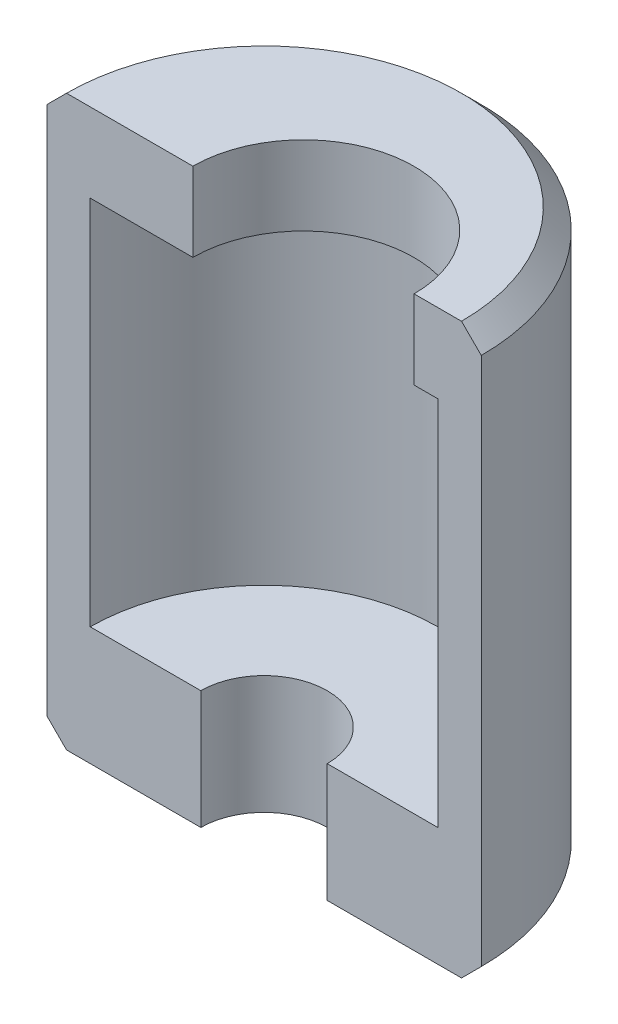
ISO-10303-21;
HEADER;
FILE_DESCRIPTION(('STEP AP214'),'2;1');
FILE_NAME('part.step','',(''),(''),'','','');
FILE_SCHEMA(('AUTOMOTIVE_DESIGN { 1 0 10303 214 1 1 1 1 }'));
ENDSEC;
DATA;
#1=APPLICATION_CONTEXT('core data for automotive mechanical design processes');
#2=APPLICATION_PROTOCOL_DEFINITION('international standard','automotive_design',2000,#1);
#3=PRODUCT_CONTEXT('',#1,'mechanical');
#4=PRODUCT('Part','Part','',(#3));
#5=PRODUCT_RELATED_PRODUCT_CATEGORY('part','',(#4));
#6=PRODUCT_DEFINITION_FORMATION('','',#4);
#7=PRODUCT_DEFINITION_CONTEXT('part definition',#1,'design');
#8=PRODUCT_DEFINITION('design','',#6,#7);
#9=PRODUCT_DEFINITION_SHAPE('','',#8);
#10=(LENGTH_UNIT() NAMED_UNIT(*) SI_UNIT(.MILLI.,.METRE.));
#11=(NAMED_UNIT(*) PLANE_ANGLE_UNIT() SI_UNIT($,.RADIAN.));
#12=(NAMED_UNIT(*) SI_UNIT($,.STERADIAN.) SOLID_ANGLE_UNIT());
#13=UNCERTAINTY_MEASURE_WITH_UNIT(LENGTH_MEASURE(1.E-05),#10,'distance_accuracy_value','');
#14=(GEOMETRIC_REPRESENTATION_CONTEXT(3) GLOBAL_UNCERTAINTY_ASSIGNED_CONTEXT((#13)) GLOBAL_UNIT_ASSIGNED_CONTEXT((#10,
#11,#12)) REPRESENTATION_CONTEXT('',''));
#15=CARTESIAN_POINT('',(0.,0.,0.));
#16=DIRECTION('',(0.,0.,1.));
#17=DIRECTION('',(1.,0.,0.));
#18=AXIS2_PLACEMENT_3D('',#15,#16,#17);
#19=CARTESIAN_POINT('',(0.,80.,0.));
#20=DIRECTION('',(0.,-1.,0.));
#21=DIRECTION('',(1.,0.,0.));
#22=AXIS2_PLACEMENT_3D('',#19,#20,#21);
#23=CYLINDRICAL_SURFACE('',#22,54.9999999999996);
#24=DIRECTION('',(0.,-1.,0.));
#25=VECTOR('',#24,1.);
#26=CARTESIAN_POINT('',(-54.9999999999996,80.0000000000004,0.));
#27=LINE('',#26,#25);
#28=CARTESIAN_POINT('',(-54.9999999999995,95.0000000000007,0.));
#29=VERTEX_POINT('',#28);
#30=CARTESIAN_POINT('',(-55.0000000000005,-38.9999999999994,0.));
#31=VERTEX_POINT('',#30);
#32=EDGE_CURVE('E159',#29,#31,#27,.T.);
#33=ORIENTED_EDGE('',*,*,#32,.F.);
#34=CARTESIAN_POINT('',(1.19695919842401E-13,95.0000000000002,0.));
#35=DIRECTION('',(0.,-1.,0.));
#36=DIRECTION('',(1.,0.,0.));
#37=AXIS2_PLACEMENT_3D('',#34,#35,#36);
#38=CIRCLE('',#37,54.9999999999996);
#39=CARTESIAN_POINT('',(54.9999999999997,94.9999999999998,0.));
#40=VERTEX_POINT('',#39);
#41=EDGE_CURVE('E124',#29,#40,#38,.T.);
#42=ORIENTED_EDGE('',*,*,#41,.T.);
#43=DIRECTION('',(0.,-1.,0.));
#44=VECTOR('',#43,1.);
#45=CARTESIAN_POINT('',(54.9999999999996,79.9999999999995,0.));
#46=LINE('',#45,#44);
#47=CARTESIAN_POINT('',(54.9999999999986,-38.9999999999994,0.));
#48=VERTEX_POINT('',#47);
#49=EDGE_CURVE('E46',#48,#40,#46,.F.);
#50=ORIENTED_EDGE('',*,*,#49,.F.);
#51=CARTESIAN_POINT('',(-9.495876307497E-13,-38.9999999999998,0.));
#52=DIRECTION('',(0.,1.,0.));
#53=DIRECTION('',(-1.,0.,0.));
#54=AXIS2_PLACEMENT_3D('',#51,#52,#53);
#55=CIRCLE('',#54,54.9999999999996);
#56=EDGE_CURVE('E121',#48,#31,#55,.T.);
#57=ORIENTED_EDGE('',*,*,#56,.T.);
#58=EDGE_LOOP('',(#33,#42,#50,#57));
#59=FACE_BOUND('',#58,.T.);
#60=ADVANCED_FACE('F32',(#59),#23,.T.);
#61=CARTESIAN_POINT('',(-16.,-44.0000000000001,0.));
#62=DIRECTION('',(0.,1.,0.));
#63=DIRECTION('',(-1.,0.,0.));
#64=AXIS2_PLACEMENT_3D('',#61,#62,#63);
#65=PLANE('',#64);
#66=DIRECTION('',(1.,0.,0.));
#67=VECTOR('',#66,1.);
#68=CARTESIAN_POINT('',(-16.,-44.0000000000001,0.));
#69=LINE('',#68,#67);
#70=CARTESIAN_POINT('',(-50.0000000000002,-43.9999999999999,0.));
#71=VERTEX_POINT('',#70);
#72=CARTESIAN_POINT('',(-16.0000000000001,-44.0000000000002,0.));
#73=VERTEX_POINT('',#72);
#74=EDGE_CURVE('E147',#71,#73,#69,.T.);
#75=ORIENTED_EDGE('',*,*,#74,.F.);
#76=CARTESIAN_POINT('',(-9.8948627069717E-13,-44.0000000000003,0.));
#77=DIRECTION('',(0.,1.,0.));
#78=DIRECTION('',(-1.,0.,0.));
#79=AXIS2_PLACEMENT_3D('',#76,#77,#78);
#80=CIRCLE('',#79,49.9999999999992);
#81=CARTESIAN_POINT('',(49.999999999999,-43.9999999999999,0.));
#82=VERTEX_POINT('',#81);
#83=EDGE_CURVE('E128',#71,#82,#80,.F.);
#84=ORIENTED_EDGE('',*,*,#83,.T.);
#85=CARTESIAN_POINT('',(15.9999999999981,-44.0000000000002,0.));
#86=VERTEX_POINT('',#85);
#87=EDGE_CURVE('E161',#86,#82,#69,.T.);
#88=ORIENTED_EDGE('',*,*,#87,.F.);
#89=CARTESIAN_POINT('',(-9.89486270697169E-13,-44.0000000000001,0.));
#90=DIRECTION('',(0.,-1.,0.));
#91=DIRECTION('',(1.,0.,0.));
#92=AXIS2_PLACEMENT_3D('',#89,#90,#91);
#93=CIRCLE('',#92,15.999999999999);
#94=EDGE_CURVE('E131',#73,#86,#93,.T.);
#95=ORIENTED_EDGE('',*,*,#94,.F.);
#96=EDGE_LOOP('',(#75,#84,#88,#95));
#97=FACE_BOUND('',#96,.T.);
#98=ADVANCED_FACE('F183',(#97),#65,.F.);
#99=CARTESIAN_POINT('',(0.,80.,0.));
#100=DIRECTION('',(0.,-1.,0.));
#101=DIRECTION('',(1.,0.,0.));
#102=AXIS2_PLACEMENT_3D('',#99,#100,#101);
#103=CYLINDRICAL_SURFACE('',#102,15.9999999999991);
#104=DIRECTION('',(0.,-1.,0.));
#105=VECTOR('',#104,1.);
#106=CARTESIAN_POINT('',(-15.9999999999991,80.0000000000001,0.));
#107=LINE('',#106,#105);
#108=CARTESIAN_POINT('',(-16.,-14.,0.));
#109=VERTEX_POINT('',#108);
#110=EDGE_CURVE('E148',#73,#109,#107,.F.);
#111=ORIENTED_EDGE('',*,*,#110,.F.);
#112=ORIENTED_EDGE('',*,*,#94,.T.);
#113=DIRECTION('',(0.,-1.,0.));
#114=VECTOR('',#113,1.);
#115=CARTESIAN_POINT('',(15.9999999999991,79.9999999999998,0.));
#116=LINE('',#115,#114);
#117=CARTESIAN_POINT('',(15.9999999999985,-14.0000000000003,0.));
#118=VERTEX_POINT('',#117);
#119=EDGE_CURVE('E163',#118,#86,#116,.T.);
#120=ORIENTED_EDGE('',*,*,#119,.F.);
#121=CARTESIAN_POINT('',(-7.5009443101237E-13,-14.0000000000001,0.));
#122=DIRECTION('',(0.,-1.,0.));
#123=DIRECTION('',(1.,0.,0.));
#124=AXIS2_PLACEMENT_3D('',#121,#122,#123);
#125=CIRCLE('',#124,15.9999999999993);
#126=EDGE_CURVE('E134',#109,#118,#125,.T.);
#127=ORIENTED_EDGE('',*,*,#126,.F.);
#128=EDGE_LOOP('',(#111,#112,#120,#127));
#129=FACE_BOUND('',#128,.T.);
#130=ADVANCED_FACE('F190',(#129),#103,.F.);
#131=CARTESIAN_POINT('',(-44.,-13.9999999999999,0.));
#132=DIRECTION('',(0.,-1.,0.));
#133=DIRECTION('',(1.,0.,0.));
#134=AXIS2_PLACEMENT_3D('',#131,#132,#133);
#135=PLANE('',#134);
#136=DIRECTION('',(-1.,0.,0.));
#137=VECTOR('',#136,1.);
#138=CARTESIAN_POINT('',(-44.,-13.9999999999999,0.));
#139=LINE('',#138,#137);
#140=CARTESIAN_POINT('',(43.9999999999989,-14.0000000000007,0.));
#141=VERTEX_POINT('',#140);
#142=EDGE_CURVE('E165',#141,#118,#139,.T.);
#143=ORIENTED_EDGE('',*,*,#142,.F.);
#144=CARTESIAN_POINT('',(-7.50094431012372E-13,-14.0000000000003,0.));
#145=DIRECTION('',(0.,-1.,0.));
#146=DIRECTION('',(1.,0.,0.));
#147=AXIS2_PLACEMENT_3D('',#144,#145,#146);
#148=CIRCLE('',#147,43.9999999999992);
#149=CARTESIAN_POINT('',(-44.0000000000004,-14.0000000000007,0.));
#150=VERTEX_POINT('',#149);
#151=EDGE_CURVE('E137',#150,#141,#148,.T.);
#152=ORIENTED_EDGE('',*,*,#151,.F.);
#153=EDGE_CURVE('E150',#109,#150,#139,.T.);
#154=ORIENTED_EDGE('',*,*,#153,.F.);
#155=ORIENTED_EDGE('',*,*,#126,.T.);
#156=EDGE_LOOP('',(#143,#152,#154,#155));
#157=FACE_BOUND('',#156,.T.);
#158=ADVANCED_FACE('F194',(#157),#135,.F.);
#159=CARTESIAN_POINT('',(0.,80.,0.));
#160=DIRECTION('',(0.,-1.,0.));
#161=DIRECTION('',(1.,0.,0.));
#162=AXIS2_PLACEMENT_3D('',#159,#160,#161);
#163=CYLINDRICAL_SURFACE('',#162,43.9999999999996);
#164=DIRECTION('',(0.,-1.,0.));
#165=VECTOR('',#164,1.);
#166=CARTESIAN_POINT('',(-43.9999999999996,80.0000000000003,0.));
#167=LINE('',#166,#165);
#168=CARTESIAN_POINT('',(-44.,80.0000000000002,0.));
#169=VERTEX_POINT('',#168);
#170=EDGE_CURVE('E151',#150,#169,#167,.F.);
#171=ORIENTED_EDGE('',*,*,#170,.F.);
#172=ORIENTED_EDGE('',*,*,#151,.T.);
#173=DIRECTION('',(0.,-1.,0.));
#174=VECTOR('',#173,1.);
#175=CARTESIAN_POINT('',(43.9999999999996,79.9999999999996,0.));
#176=LINE('',#175,#174);
#177=CARTESIAN_POINT('',(44.,79.9999999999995,0.));
#178=VERTEX_POINT('',#177);
#179=EDGE_CURVE('E167',#178,#141,#176,.T.);
#180=ORIENTED_EDGE('',*,*,#179,.F.);
#181=CARTESIAN_POINT('',(0.,79.9999999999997,0.));
#182=DIRECTION('',(0.,-1.,0.));
#183=DIRECTION('',(1.,0.,0.));
#184=AXIS2_PLACEMENT_3D('',#181,#182,#183);
#185=CIRCLE('',#184,44.);
#186=EDGE_CURVE('E140',#169,#178,#185,.T.);
#187=ORIENTED_EDGE('',*,*,#186,.F.);
#188=EDGE_LOOP('',(#171,#172,#180,#187));
#189=FACE_BOUND('',#188,.T.);
#190=ADVANCED_FACE('F200',(#189),#163,.F.);
#191=CARTESIAN_POINT('',(0.,79.9999999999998,0.));
#192=DIRECTION('',(0.,1.,0.));
#193=DIRECTION('',(-1.,0.,0.));
#194=AXIS2_PLACEMENT_3D('',#191,#192,#193);
#195=PLANE('',#194);
#196=DIRECTION('',(1.,0.,0.));
#197=VECTOR('',#196,1.);
#198=CARTESIAN_POINT('',(0.,79.9999999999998,0.));
#199=LINE('',#198,#197);
#200=CARTESIAN_POINT('',(-18.0096679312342,79.9999999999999,0.));
#201=VERTEX_POINT('',#200);
#202=EDGE_CURVE('E153',#169,#201,#199,.T.);
#203=ORIENTED_EDGE('',*,*,#202,.F.);
#204=ORIENTED_EDGE('',*,*,#186,.T.);
#205=CARTESIAN_POINT('',(37.9903107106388,79.9999999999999,0.));
#206=VERTEX_POINT('',#205);
#207=EDGE_CURVE('E169',#206,#178,#199,.T.);
#208=ORIENTED_EDGE('',*,*,#207,.F.);
#209=CARTESIAN_POINT('',(9.99032138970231,79.9999999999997,0.0244545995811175));
#210=DIRECTION('',(0.,1.,0.));
#211=DIRECTION('',(-1.,0.,0.));
#212=AXIS2_PLACEMENT_3D('',#209,#210,#211);
#213=CIRCLE('',#212,28.);
#214=EDGE_CURVE('E143',#201,#206,#213,.F.);
#215=ORIENTED_EDGE('',*,*,#214,.F.);
#216=EDGE_LOOP('',(#203,#204,#208,#215));
#217=FACE_BOUND('',#216,.T.);
#218=ADVANCED_FACE('F204',(#217),#195,.F.);
#219=CARTESIAN_POINT('',(1.59594559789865E-13,99.9999999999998,0.));
#220=DIRECTION('',(0.,-1.,0.));
#221=DIRECTION('',(1.,0.,0.));
#222=AXIS2_PLACEMENT_3D('',#219,#220,#221);
#223=PLANE('',#222);
#224=DIRECTION('',(-1.,0.,0.));
#225=VECTOR('',#224,1.);
#226=CARTESIAN_POINT('',(1.59594559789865E-13,99.9999999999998,0.));
#227=LINE('',#226,#225);
#228=CARTESIAN_POINT('',(50.0000000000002,99.9999999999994,0.));
#229=VERTEX_POINT('',#228);
#230=CARTESIAN_POINT('',(37.990310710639,99.9999999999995,0.));
#231=VERTEX_POINT('',#230);
#232=EDGE_CURVE('E106',#229,#231,#227,.T.);
#233=ORIENTED_EDGE('',*,*,#232,.F.);
#234=CARTESIAN_POINT('',(1.59594559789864E-13,99.9999999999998,0.));
#235=DIRECTION('',(0.,-1.,0.));
#236=DIRECTION('',(1.,0.,0.));
#237=AXIS2_PLACEMENT_3D('',#234,#235,#236);
#238=CIRCLE('',#237,50.);
#239=CARTESIAN_POINT('',(-49.9999999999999,100.,0.));
#240=VERTEX_POINT('',#239);
#241=EDGE_CURVE('E112',#229,#240,#238,.F.);
#242=ORIENTED_EDGE('',*,*,#241,.T.);
#243=CARTESIAN_POINT('',(-18.0096679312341,99.9999999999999,0.));
#244=VERTEX_POINT('',#243);
#245=EDGE_CURVE('E54',#244,#240,#227,.T.);
#246=ORIENTED_EDGE('',*,*,#245,.F.);
#247=CARTESIAN_POINT('',(9.99032138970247,99.9999999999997,0.0244545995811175));
#248=DIRECTION('',(0.,1.,0.));
#249=DIRECTION('',(-1.,0.,0.));
#250=AXIS2_PLACEMENT_3D('',#247,#248,#249);
#251=CIRCLE('',#250,28.);
#252=EDGE_CURVE('E118',#231,#244,#251,.T.);
#253=ORIENTED_EDGE('',*,*,#252,.F.);
#254=EDGE_LOOP('',(#233,#242,#246,#253));
#255=FACE_BOUND('',#254,.T.);
#256=ADVANCED_FACE('F116',(#255),#223,.F.);
#257=CARTESIAN_POINT('',(9.99032138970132,-44.0010000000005,0.0244545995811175));
#258=DIRECTION('',(0.,1.,0.));
#259=DIRECTION('',(-1.,0.,0.));
#260=AXIS2_PLACEMENT_3D('',#257,#258,#259);
#261=CYLINDRICAL_SURFACE('',#260,28.);
#262=DIRECTION('',(0.,1.,0.));
#263=VECTOR('',#262,1.);
#264=CARTESIAN_POINT('',(37.9903107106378,-44.0010000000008,0.));
#265=LINE('',#264,#263);
#266=EDGE_CURVE('E171',#231,#206,#265,.F.);
#267=ORIENTED_EDGE('',*,*,#266,.F.);
#268=ORIENTED_EDGE('',*,*,#252,.T.);
#269=DIRECTION('',(0.,1.,0.));
#270=VECTOR('',#269,1.);
#271=CARTESIAN_POINT('',(-18.0096679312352,-44.0010000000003,0.));
#272=LINE('',#271,#270);
#273=EDGE_CURVE('E154',#201,#244,#272,.T.);
#274=ORIENTED_EDGE('',*,*,#273,.F.);
#275=ORIENTED_EDGE('',*,*,#214,.T.);
#276=EDGE_LOOP('',(#267,#268,#274,#275));
#277=FACE_BOUND('',#276,.T.);
#278=ADVANCED_FACE('F208',(#277),#261,.F.);
#279=CARTESIAN_POINT('',(-9.8948627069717E-13,-44.0000000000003,0.));
#280=DIRECTION('',(0.,1.,0.));
#281=DIRECTION('',(-1.,0.,0.));
#282=AXIS2_PLACEMENT_3D('',#279,#280,#281);
#283=CONICAL_SURFACE('',#282,49.9999999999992,0.785398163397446);
#284=ORIENTED_EDGE('',*,*,#56,.F.);
#285=DIRECTION('',(0.707106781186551,0.707106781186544,0.));
#286=VECTOR('',#285,1.);
#287=CARTESIAN_POINT('',(-1.38847267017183E-12,-93.9999999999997,0.));
#288=LINE('',#287,#286);
#289=EDGE_CURVE('E173',#48,#82,#288,.F.);
#290=ORIENTED_EDGE('',*,*,#289,.T.);
#291=ORIENTED_EDGE('',*,*,#83,.F.);
#292=DIRECTION('',(0.70710678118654,-0.707106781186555,0.));
#293=VECTOR('',#292,1.);
#294=CARTESIAN_POINT('',(-1.38847267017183E-12,-93.9999999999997,0.));
#295=LINE('',#294,#293);
#296=EDGE_CURVE('E156',#71,#31,#295,.F.);
#297=ORIENTED_EDGE('',*,*,#296,.T.);
#298=EDGE_LOOP('',(#284,#290,#291,#297));
#299=FACE_BOUND('',#298,.T.);
#300=ADVANCED_FACE('F179',(#299),#283,.T.);
#301=CARTESIAN_POINT('',(1.19695919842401E-13,95.0000000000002,0.));
#302=DIRECTION('',(0.,-1.,0.));
#303=DIRECTION('',(1.,0.,0.));
#304=AXIS2_PLACEMENT_3D('',#301,#302,#303);
#305=CONICAL_SURFACE('',#304,54.9999999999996,0.785398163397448);
#306=ORIENTED_EDGE('',*,*,#41,.F.);
#307=DIRECTION('',(-0.707106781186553,-0.707106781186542,0.));
#308=VECTOR('',#307,1.);
#309=CARTESIAN_POINT('',(5.58580959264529E-13,150.,0.));
#310=LINE('',#309,#308);
#311=EDGE_CURVE('E11',#29,#240,#310,.F.);
#312=ORIENTED_EDGE('',*,*,#311,.T.);
#313=ORIENTED_EDGE('',*,*,#241,.F.);
#314=DIRECTION('',(-0.707106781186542,0.707106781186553,0.));
#315=VECTOR('',#314,1.);
#316=CARTESIAN_POINT('',(5.58580959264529E-13,150.,0.));
#317=LINE('',#316,#315);
#318=EDGE_CURVE('E39',#229,#40,#317,.F.);
#319=ORIENTED_EDGE('',*,*,#318,.T.);
#320=EDGE_LOOP('',(#306,#312,#313,#319));
#321=FACE_BOUND('',#320,.T.);
#322=ADVANCED_FACE('F120',(#321),#305,.T.);
#323=CARTESIAN_POINT('',(-88.7982510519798,-52.6824136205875,0.));
#324=DIRECTION('',(0.,0.,1.));
#325=DIRECTION('',(1.,0.,0.));
#326=AXIS2_PLACEMENT_3D('',#323,#324,#325);
#327=PLANE('',#326);
#328=ORIENTED_EDGE('',*,*,#87,.T.);
#329=ORIENTED_EDGE('',*,*,#289,.F.);
#330=ORIENTED_EDGE('',*,*,#49,.T.);
#331=ORIENTED_EDGE('',*,*,#318,.F.);
#332=ORIENTED_EDGE('',*,*,#232,.T.);
#333=ORIENTED_EDGE('',*,*,#266,.T.);
#334=ORIENTED_EDGE('',*,*,#207,.T.);
#335=ORIENTED_EDGE('',*,*,#179,.T.);
#336=ORIENTED_EDGE('',*,*,#142,.T.);
#337=ORIENTED_EDGE('',*,*,#119,.T.);
#338=EDGE_LOOP('',(#328,#329,#330,#331,#332,#333,#334,#335,#336,#337));
#339=FACE_BOUND('',#338,.T.);
#340=ADVANCED_FACE('F105',(#339),#327,.T.);
#341=ORIENTED_EDGE('',*,*,#74,.T.);
#342=ORIENTED_EDGE('',*,*,#110,.T.);
#343=ORIENTED_EDGE('',*,*,#153,.T.);
#344=ORIENTED_EDGE('',*,*,#170,.T.);
#345=ORIENTED_EDGE('',*,*,#202,.T.);
#346=ORIENTED_EDGE('',*,*,#273,.T.);
#347=ORIENTED_EDGE('',*,*,#245,.T.);
#348=ORIENTED_EDGE('',*,*,#311,.F.);
#349=ORIENTED_EDGE('',*,*,#32,.T.);
#350=ORIENTED_EDGE('',*,*,#296,.F.);
#351=EDGE_LOOP('',(#341,#342,#343,#344,#345,#346,#347,#348,#349,#350));
#352=FACE_BOUND('',#351,.T.);
#353=ADVANCED_FACE('F186',(#352),#327,.T.);
#354=CLOSED_SHELL('',(#60,#98,#130,#158,#190,#218,#256,#278,#300,#322,#340,#353));
#355=MANIFOLD_SOLID_BREP('B2',#354);
#356=ADVANCED_BREP_SHAPE_REPRESENTATION('',(#18,#355),#14);
#357=SHAPE_DEFINITION_REPRESENTATION(#9,#356);
ENDSEC;
END-ISO-10303-21;
